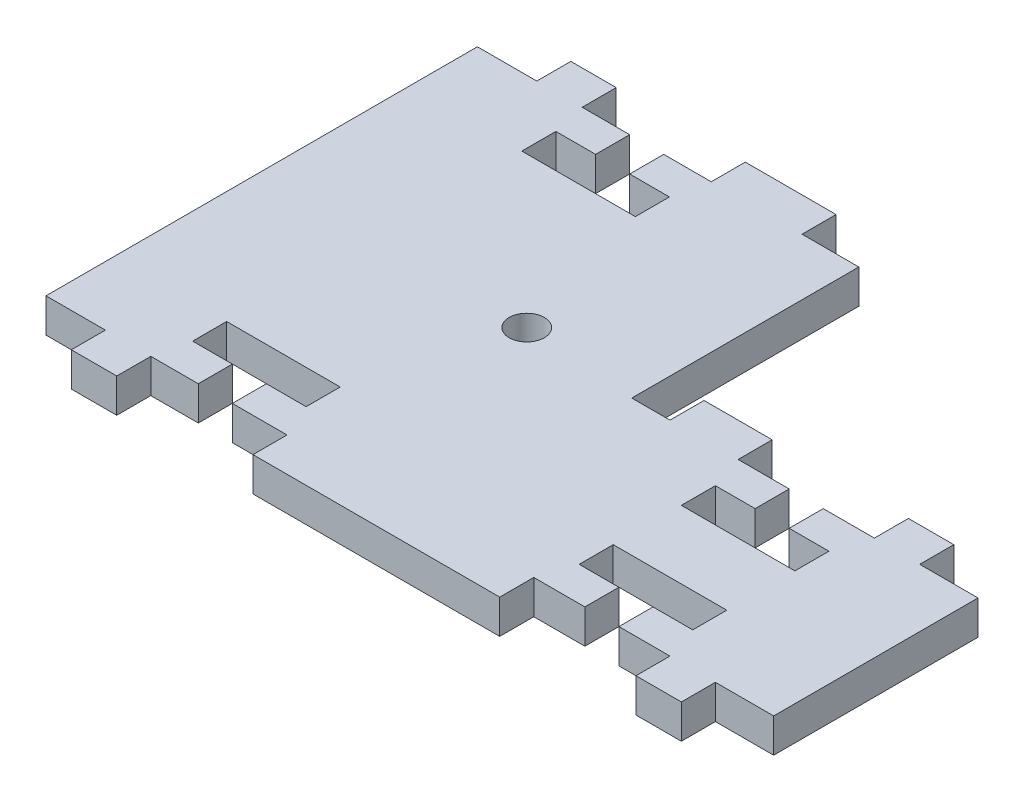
from build123d import *

# Parameters (mm, degrees)
SKETCH1_R           = 1.55
BOSS_EXTRUDE1_DEPTH = 3


with BuildPart() as part:
    # Sketch1 → Boss-Extrude1 (new body)
    with BuildSketch(Plane(origin=(0, 0, 0), x_dir=(1, 0, 0), z_dir=(0, 1, 0))):
        Polygon((74.683753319, 219.09410576), (69.551868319, 219.09410576), (69.551868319, 216.09410576), (65.551868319, 216.09410576), (65.551868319, 219.09410576), (61.051868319, 219.09410576), (61.051868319, 222.09410576), (64.551868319, 222.09410576), (64.551868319, 225.09410576), (54.551868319, 225.09410576), (54.551868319, 222.09410576), (58.051868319, 222.09410576), (58.051868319, 219.09410576), (53.551868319, 219.09410576), (53.551868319, 216.09410576), (31.815637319, 216.09410576), (31.815637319, 219.09410576), (26.999695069, 219.09410576), (26.999695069, 222.09410576), (30.499695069, 222.09410576), (30.499695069, 225.09410576), (20.499695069, 225.09410576), (20.499695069, 222.09410576), (23.999695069, 222.09410576), (23.999695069, 219.09410576), (19.815637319, 219.09410576), (19.815637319, 216.09410576), (15.815637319, 216.09410576), (15.815637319, 219.09410576), (10.583753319, 219.09410576), (10.583753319, 257.09410576), (15.815637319, 257.09410576), (15.815637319, 260.09410576), (19.815637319, 260.09410576), (19.815637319, 257.09410576), (23.999695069, 257.09410576), (23.999695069, 254.09410576), (20.499695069, 254.09410576), (20.499695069, 251.09410576), (30.499695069, 251.09410576), (30.499695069, 254.09410576), (26.999695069, 254.09410576), (26.999695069, 257.09410576), (31.183752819, 257.09410576), (31.183752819, 260.09410576), (39.183752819, 260.09410576), (39.183752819, 257.09410576), (44.183752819, 257.09410576), (44.183752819, 237.09410576), (47.551868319, 237.09410576), (47.551868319, 240.09410576), (53.551868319, 240.09410576), (53.551868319, 237.09410576), (58.051868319, 237.09410576), (58.051868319, 234.09410576), (54.551868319, 234.09410576), (54.551868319, 231.09410576), (64.551868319, 231.09410576), (64.551868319, 234.09410576), (61.051868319, 234.09410576), (61.051868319, 237.09410576), (65.551868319, 237.09410576), (65.551868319, 240.09410576), (69.551868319, 240.09410576), (69.551868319, 237.09410576), (74.683753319, 237.09410576), align=None)
        with Locations(Location((34.183752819, 237.84410576, 0), (0, 0, 270))):
            Circle(SKETCH1_R, mode=Mode.SUBTRACT)
    extrude(amount=BOSS_EXTRUDE1_DEPTH)


solid = part.part
